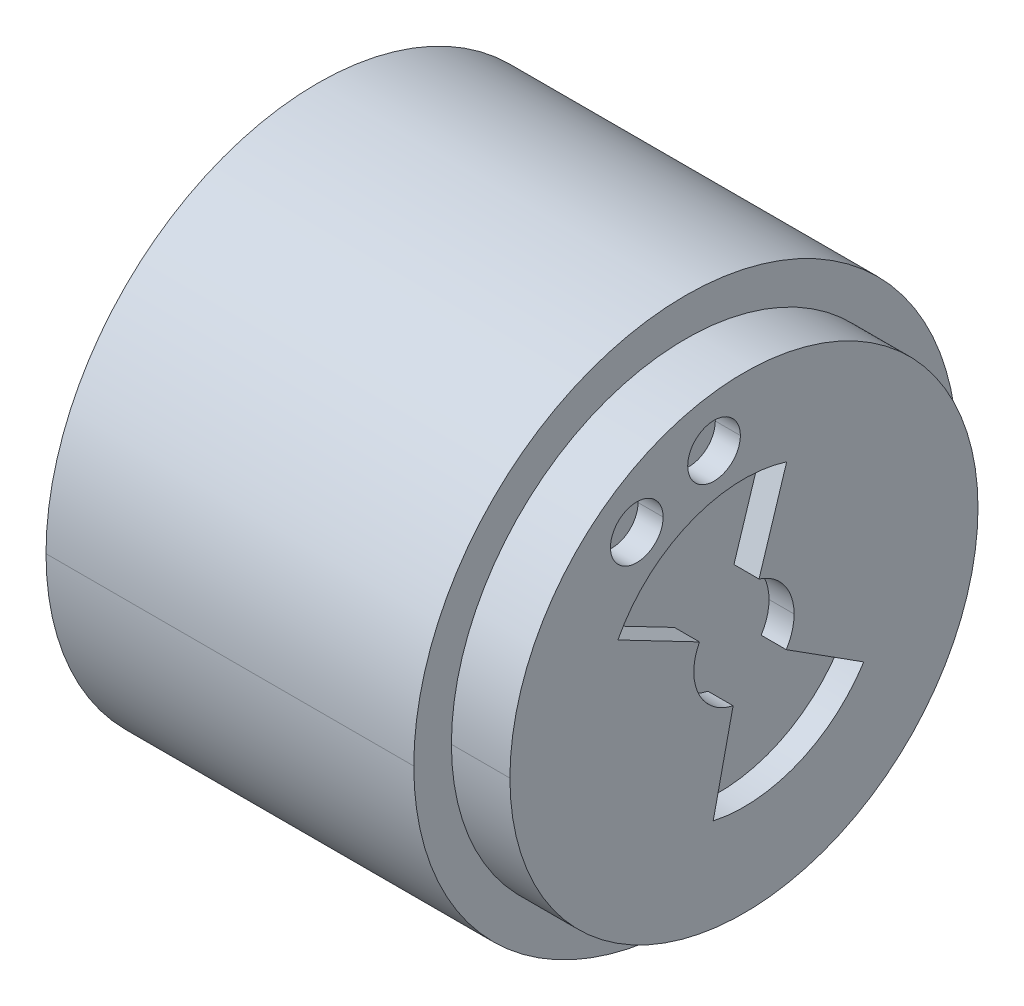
ISO-10303-21;
HEADER;
FILE_DESCRIPTION(('STEP AP214'),'2;1');
FILE_NAME('part.step','',(''),(''),'','','');
FILE_SCHEMA(('AUTOMOTIVE_DESIGN { 1 0 10303 214 1 1 1 1 }'));
ENDSEC;
DATA;
#1=APPLICATION_CONTEXT('core data for automotive mechanical design processes');
#2=APPLICATION_PROTOCOL_DEFINITION('international standard','automotive_design',2000,#1);
#3=PRODUCT_CONTEXT('',#1,'mechanical');
#4=PRODUCT('Part','Part','',(#3));
#5=PRODUCT_RELATED_PRODUCT_CATEGORY('part','',(#4));
#6=PRODUCT_DEFINITION_FORMATION('','',#4);
#7=PRODUCT_DEFINITION_CONTEXT('part definition',#1,'design');
#8=PRODUCT_DEFINITION('design','',#6,#7);
#9=PRODUCT_DEFINITION_SHAPE('','',#8);
#10=(LENGTH_UNIT() NAMED_UNIT(*) SI_UNIT(.MILLI.,.METRE.));
#11=(NAMED_UNIT(*) PLANE_ANGLE_UNIT() SI_UNIT($,.RADIAN.));
#12=(NAMED_UNIT(*) SI_UNIT($,.STERADIAN.) SOLID_ANGLE_UNIT());
#13=UNCERTAINTY_MEASURE_WITH_UNIT(LENGTH_MEASURE(1.E-05),#10,'distance_accuracy_value','');
#14=(GEOMETRIC_REPRESENTATION_CONTEXT(3) GLOBAL_UNCERTAINTY_ASSIGNED_CONTEXT((#13)) GLOBAL_UNIT_ASSIGNED_CONTEXT((#10,
#11,#12)) REPRESENTATION_CONTEXT('',''));
#15=CARTESIAN_POINT('',(0.,0.,0.));
#16=DIRECTION('',(0.,0.,1.));
#17=DIRECTION('',(1.,0.,0.));
#18=AXIS2_PLACEMENT_3D('',#15,#16,#17);
#19=CARTESIAN_POINT('',(48.,0.,0.));
#20=DIRECTION('',(1.,0.,0.));
#21=DIRECTION('',(0.,1.,0.));
#22=AXIS2_PLACEMENT_3D('',#19,#20,#21);
#23=PLANE('',#22);
#24=CARTESIAN_POINT('',(48.,0.,0.));
#25=DIRECTION('',(1.,0.,0.));
#26=DIRECTION('',(0.,0.,-1.));
#27=AXIS2_PLACEMENT_3D('',#24,#25,#26);
#28=CIRCLE('',#27,6.);
#29=CARTESIAN_POINT('',(48.,2.77049167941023,5.32206499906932));
#30=VERTEX_POINT('',#29);
#31=CARTESIAN_POINT('',(48.,-5.8577760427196,1.29863768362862));
#32=VERTEX_POINT('',#31);
#33=EDGE_CURVE('E329',#30,#32,#28,.T.);
#34=ORIENTED_EDGE('',*,*,#33,.T.);
#35=DIRECTION('',(0.,-0.976296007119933,0.216439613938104));
#36=VECTOR('',#35,1.);
#37=CARTESIAN_POINT('',(48.,-5.8577760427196,1.29863768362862));
#38=LINE('',#37,#36);
#39=CARTESIAN_POINT('',(48.,-16.5970321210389,3.67947343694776));
#40=VERTEX_POINT('',#39);
#41=EDGE_CURVE('E11',#32,#40,#38,.T.);
#42=ORIENTED_EDGE('',*,*,#41,.T.);
#43=CARTESIAN_POINT('',(48.,0.,0.));
#44=DIRECTION('',(1.,0.,0.));
#45=DIRECTION('',(0.,0.,-1.));
#46=AXIS2_PLACEMENT_3D('',#43,#44,#45);
#47=CIRCLE('',#46,17.);
#48=CARTESIAN_POINT('',(48.,-9.13409334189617,-14.337654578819));
#49=VERTEX_POINT('',#48);
#50=EDGE_CURVE('E231',#40,#49,#47,.T.);
#51=ORIENTED_EDGE('',*,*,#50,.T.);
#52=DIRECTION('',(0.,0.537299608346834,0.84339144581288));
#53=VECTOR('',#52,1.);
#54=CARTESIAN_POINT('',(48.,-3.223797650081,-5.06034867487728));
#55=LINE('',#54,#53);
#56=CARTESIAN_POINT('',(48.,-3.223797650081,-5.06034867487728));
#57=VERTEX_POINT('',#56);
#58=EDGE_CURVE('E389',#49,#57,#55,.T.);
#59=ORIENTED_EDGE('',*,*,#58,.T.);
#60=CARTESIAN_POINT('',(48.,0.,0.));
#61=DIRECTION('',(1.,0.,0.));
#62=DIRECTION('',(0.,0.,-1.));
#63=AXIS2_PLACEMENT_3D('',#60,#61,#62);
#64=CIRCLE('',#63,6.);
#65=CARTESIAN_POINT('',(48.,0.,-6.));
#66=VERTEX_POINT('',#65);
#67=EDGE_CURVE('E317',#57,#66,#64,.T.);
#68=ORIENTED_EDGE('',*,*,#67,.T.);
#69=CARTESIAN_POINT('',(48.,0.,0.));
#70=DIRECTION('',(1.,0.,0.));
#71=DIRECTION('',(0.,0.,-1.));
#72=AXIS2_PLACEMENT_3D('',#69,#70,#71);
#73=CIRCLE('',#72,6.);
#74=CARTESIAN_POINT('',(48.,5.72230170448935,-1.80423479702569));
#75=VERTEX_POINT('',#74);
#76=EDGE_CURVE('E290',#66,#75,#73,.T.);
#77=ORIENTED_EDGE('',*,*,#76,.T.);
#78=DIRECTION('',(0.,0.953716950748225,-0.300705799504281));
#79=VECTOR('',#78,1.);
#80=CARTESIAN_POINT('',(48.,16.2131881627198,-5.11199859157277));
#81=LINE('',#80,#79);
#82=CARTESIAN_POINT('',(48.,16.2131881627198,-5.11199859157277));
#83=VERTEX_POINT('',#82);
#84=EDGE_CURVE('E320',#75,#83,#81,.T.);
#85=ORIENTED_EDGE('',*,*,#84,.T.);
#86=CARTESIAN_POINT('',(48.,0.,0.));
#87=DIRECTION('',(1.,0.,0.));
#88=DIRECTION('',(0.,0.,-1.));
#89=AXIS2_PLACEMENT_3D('',#86,#87,#88);
#90=CIRCLE('',#89,17.);
#91=CARTESIAN_POINT('',(48.,7.84972642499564,15.0791841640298));
#92=VERTEX_POINT('',#91);
#93=EDGE_CURVE('E333',#83,#92,#90,.T.);
#94=ORIENTED_EDGE('',*,*,#93,.T.);
#95=DIRECTION('',(0.,-0.461748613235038,-0.88701083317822));
#96=VECTOR('',#95,1.);
#97=CARTESIAN_POINT('',(48.,7.84972642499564,15.0791841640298));
#98=LINE('',#97,#96);
#99=EDGE_CURVE('E334',#92,#30,#98,.T.);
#100=ORIENTED_EDGE('',*,*,#99,.T.);
#101=EDGE_LOOP('',(#34,#42,#51,#59,#68,#77,#85,#94,#100));
#102=FACE_BOUND('',#101,.T.);
#103=ADVANCED_FACE('F16',(#102),#23,.T.);
#104=CARTESIAN_POINT('',(48.,-5.8577760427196,1.29863768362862));
#105=DIRECTION('',(0.,0.216439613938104,0.976296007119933));
#106=DIRECTION('',(1.,0.,0.));
#107=AXIS2_PLACEMENT_3D('',#104,#105,#106);
#108=PLANE('',#107);
#109=DIRECTION('',(0.,-0.976296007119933,0.216439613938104));
#110=VECTOR('',#109,1.);
#111=CARTESIAN_POINT('',(51.,-5.8577760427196,1.29863768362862));
#112=LINE('',#111,#110);
#113=CARTESIAN_POINT('',(51.,-5.8577760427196,1.29863768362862));
#114=VERTEX_POINT('',#113);
#115=CARTESIAN_POINT('',(51.,-16.5970321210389,3.67947343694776));
#116=VERTEX_POINT('',#115);
#117=EDGE_CURVE('E236',#114,#116,#112,.T.);
#118=ORIENTED_EDGE('',*,*,#117,.T.);
#119=DIRECTION('',(1.,0.,0.));
#120=VECTOR('',#119,1.);
#121=CARTESIAN_POINT('',(48.,-16.5970321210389,3.67947343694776));
#122=LINE('',#121,#120);
#123=EDGE_CURVE('E27',#40,#116,#122,.T.);
#124=ORIENTED_EDGE('',*,*,#123,.F.);
#125=ORIENTED_EDGE('',*,*,#41,.F.);
#126=DIRECTION('',(1.,0.,0.));
#127=VECTOR('',#126,1.);
#128=CARTESIAN_POINT('',(48.,-5.8577760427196,1.29863768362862));
#129=LINE('',#128,#127);
#130=EDGE_CURVE('E239',#32,#114,#129,.T.);
#131=ORIENTED_EDGE('',*,*,#130,.T.);
#132=EDGE_LOOP('',(#118,#124,#125,#131));
#133=FACE_BOUND('',#132,.T.);
#134=ADVANCED_FACE('F237',(#133),#108,.F.);
#135=CARTESIAN_POINT('',(48.,0.,0.));
#136=DIRECTION('',(1.,0.,0.));
#137=DIRECTION('',(0.,0.,-1.));
#138=AXIS2_PLACEMENT_3D('',#135,#136,#137);
#139=CYLINDRICAL_SURFACE('',#138,17.);
#140=CARTESIAN_POINT('',(51.,0.,0.));
#141=DIRECTION('',(1.,0.,0.));
#142=DIRECTION('',(0.,0.,-1.));
#143=AXIS2_PLACEMENT_3D('',#140,#141,#142);
#144=CIRCLE('',#143,17.);
#145=CARTESIAN_POINT('',(51.,-9.13409334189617,-14.337654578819));
#146=VERTEX_POINT('',#145);
#147=EDGE_CURVE('E229',#116,#146,#144,.T.);
#148=ORIENTED_EDGE('',*,*,#147,.T.);
#149=DIRECTION('',(1.,0.,0.));
#150=VECTOR('',#149,1.);
#151=CARTESIAN_POINT('',(48.,-9.13409334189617,-14.337654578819));
#152=LINE('',#151,#150);
#153=EDGE_CURVE('E313',#49,#146,#152,.T.);
#154=ORIENTED_EDGE('',*,*,#153,.F.);
#155=ORIENTED_EDGE('',*,*,#50,.F.);
#156=ORIENTED_EDGE('',*,*,#123,.T.);
#157=EDGE_LOOP('',(#148,#154,#155,#156));
#158=FACE_BOUND('',#157,.T.);
#159=ADVANCED_FACE('F226',(#158),#139,.F.);
#160=CARTESIAN_POINT('',(48.,-3.223797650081,-5.06034867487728));
#161=DIRECTION('',(0.,0.84339144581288,-0.537299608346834));
#162=DIRECTION('',(-1.,0.,0.));
#163=AXIS2_PLACEMENT_3D('',#160,#161,#162);
#164=PLANE('',#163);
#165=DIRECTION('',(0.,0.537299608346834,0.84339144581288));
#166=VECTOR('',#165,1.);
#167=CARTESIAN_POINT('',(51.,-3.223797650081,-5.06034867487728));
#168=LINE('',#167,#166);
#169=CARTESIAN_POINT('',(51.,-3.223797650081,-5.06034867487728));
#170=VERTEX_POINT('',#169);
#171=EDGE_CURVE('E248',#146,#170,#168,.T.);
#172=ORIENTED_EDGE('',*,*,#171,.T.);
#173=DIRECTION('',(1.,0.,0.));
#174=VECTOR('',#173,1.);
#175=CARTESIAN_POINT('',(48.,-3.223797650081,-5.06034867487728));
#176=LINE('',#175,#174);
#177=EDGE_CURVE('E152',#57,#170,#176,.T.);
#178=ORIENTED_EDGE('',*,*,#177,.F.);
#179=ORIENTED_EDGE('',*,*,#58,.F.);
#180=ORIENTED_EDGE('',*,*,#153,.T.);
#181=EDGE_LOOP('',(#172,#178,#179,#180));
#182=FACE_BOUND('',#181,.T.);
#183=ADVANCED_FACE('F735',(#182),#164,.F.);
#184=CARTESIAN_POINT('',(48.,0.,0.));
#185=DIRECTION('',(1.,0.,0.));
#186=DIRECTION('',(0.,0.,-1.));
#187=AXIS2_PLACEMENT_3D('',#184,#185,#186);
#188=CYLINDRICAL_SURFACE('',#187,6.);
#189=DIRECTION('',(1.,0.,0.));
#190=VECTOR('',#189,1.);
#191=CARTESIAN_POINT('',(48.,0.,-6.));
#192=LINE('',#191,#190);
#193=CARTESIAN_POINT('',(51.,0.,-6.));
#194=VERTEX_POINT('',#193);
#195=EDGE_CURVE('E285',#66,#194,#192,.T.);
#196=ORIENTED_EDGE('',*,*,#195,.F.);
#197=ORIENTED_EDGE('',*,*,#67,.F.);
#198=ORIENTED_EDGE('',*,*,#177,.T.);
#199=CARTESIAN_POINT('',(51.,0.,0.));
#200=DIRECTION('',(1.,0.,0.));
#201=DIRECTION('',(0.,0.,-1.));
#202=AXIS2_PLACEMENT_3D('',#199,#200,#201);
#203=CIRCLE('',#202,6.);
#204=EDGE_CURVE('E255',#170,#194,#203,.T.);
#205=ORIENTED_EDGE('',*,*,#204,.T.);
#206=EDGE_LOOP('',(#196,#197,#198,#205));
#207=FACE_BOUND('',#206,.T.);
#208=ADVANCED_FACE('F462',(#207),#188,.F.);
#209=CARTESIAN_POINT('',(48.,16.2131881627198,-5.11199859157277));
#210=DIRECTION('',(0.,-0.300705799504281,-0.953716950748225));
#211=DIRECTION('',(0.,-0.953716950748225,0.300705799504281));
#212=AXIS2_PLACEMENT_3D('',#209,#210,#211);
#213=PLANE('',#212);
#214=DIRECTION('',(0.,0.953716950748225,-0.300705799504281));
#215=VECTOR('',#214,1.);
#216=CARTESIAN_POINT('',(51.,16.2131881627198,-5.11199859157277));
#217=LINE('',#216,#215);
#218=CARTESIAN_POINT('',(51.,5.72230170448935,-1.80423479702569));
#219=VERTEX_POINT('',#218);
#220=CARTESIAN_POINT('',(51.,16.2131881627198,-5.11199859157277));
#221=VERTEX_POINT('',#220);
#222=EDGE_CURVE('E351',#219,#221,#217,.T.);
#223=ORIENTED_EDGE('',*,*,#222,.T.);
#224=DIRECTION('',(1.,0.,0.));
#225=VECTOR('',#224,1.);
#226=CARTESIAN_POINT('',(48.,16.2131881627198,-5.11199859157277));
#227=LINE('',#226,#225);
#228=EDGE_CURVE('E169',#83,#221,#227,.T.);
#229=ORIENTED_EDGE('',*,*,#228,.F.);
#230=ORIENTED_EDGE('',*,*,#84,.F.);
#231=DIRECTION('',(1.,0.,0.));
#232=VECTOR('',#231,1.);
#233=CARTESIAN_POINT('',(48.,5.72230170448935,-1.80423479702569));
#234=LINE('',#233,#232);
#235=EDGE_CURVE('E305',#75,#219,#234,.T.);
#236=ORIENTED_EDGE('',*,*,#235,.T.);
#237=EDGE_LOOP('',(#223,#229,#230,#236));
#238=FACE_BOUND('',#237,.T.);
#239=ADVANCED_FACE('F459',(#238),#213,.F.);
#240=CARTESIAN_POINT('',(48.,0.,0.));
#241=DIRECTION('',(1.,0.,0.));
#242=DIRECTION('',(0.,0.,-1.));
#243=AXIS2_PLACEMENT_3D('',#240,#241,#242);
#244=CYLINDRICAL_SURFACE('',#243,17.);
#245=CARTESIAN_POINT('',(51.,0.,0.));
#246=DIRECTION('',(1.,0.,0.));
#247=DIRECTION('',(0.,0.,-1.));
#248=AXIS2_PLACEMENT_3D('',#245,#246,#247);
#249=CIRCLE('',#248,17.);
#250=CARTESIAN_POINT('',(51.,7.84972642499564,15.0791841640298));
#251=VERTEX_POINT('',#250);
#252=EDGE_CURVE('E280',#221,#251,#249,.T.);
#253=ORIENTED_EDGE('',*,*,#252,.T.);
#254=DIRECTION('',(1.,0.,0.));
#255=VECTOR('',#254,1.);
#256=CARTESIAN_POINT('',(48.,7.84972642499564,15.0791841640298));
#257=LINE('',#256,#255);
#258=EDGE_CURVE('E330',#92,#251,#257,.T.);
#259=ORIENTED_EDGE('',*,*,#258,.F.);
#260=ORIENTED_EDGE('',*,*,#93,.F.);
#261=ORIENTED_EDGE('',*,*,#228,.T.);
#262=EDGE_LOOP('',(#253,#259,#260,#261));
#263=FACE_BOUND('',#262,.T.);
#264=ADVANCED_FACE('F457',(#263),#244,.F.);
#265=CARTESIAN_POINT('',(48.,7.84972642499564,15.0791841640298));
#266=DIRECTION('',(0.,-0.88701083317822,0.461748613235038));
#267=DIRECTION('',(-1.,0.,0.));
#268=AXIS2_PLACEMENT_3D('',#265,#266,#267);
#269=PLANE('',#268);
#270=DIRECTION('',(0.,-0.461748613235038,-0.88701083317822));
#271=VECTOR('',#270,1.);
#272=CARTESIAN_POINT('',(51.,7.84972642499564,15.0791841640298));
#273=LINE('',#272,#271);
#274=CARTESIAN_POINT('',(51.,2.77049167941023,5.32206499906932));
#275=VERTEX_POINT('',#274);
#276=EDGE_CURVE('E276',#251,#275,#273,.T.);
#277=ORIENTED_EDGE('',*,*,#276,.T.);
#278=DIRECTION('',(1.,0.,0.));
#279=VECTOR('',#278,1.);
#280=CARTESIAN_POINT('',(48.,2.77049167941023,5.32206499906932));
#281=LINE('',#280,#279);
#282=EDGE_CURVE('E365',#30,#275,#281,.T.);
#283=ORIENTED_EDGE('',*,*,#282,.F.);
#284=ORIENTED_EDGE('',*,*,#99,.F.);
#285=ORIENTED_EDGE('',*,*,#258,.T.);
#286=EDGE_LOOP('',(#277,#283,#284,#285));
#287=FACE_BOUND('',#286,.T.);
#288=ADVANCED_FACE('F473',(#287),#269,.F.);
#289=CARTESIAN_POINT('',(48.,0.,0.));
#290=DIRECTION('',(1.,0.,0.));
#291=DIRECTION('',(0.,0.,-1.));
#292=AXIS2_PLACEMENT_3D('',#289,#290,#291);
#293=CYLINDRICAL_SURFACE('',#292,6.);
#294=CARTESIAN_POINT('',(51.,0.,0.));
#295=DIRECTION('',(1.,0.,0.));
#296=DIRECTION('',(0.,0.,-1.));
#297=AXIS2_PLACEMENT_3D('',#294,#295,#296);
#298=CIRCLE('',#297,6.);
#299=EDGE_CURVE('E281',#275,#114,#298,.T.);
#300=ORIENTED_EDGE('',*,*,#299,.T.);
#301=ORIENTED_EDGE('',*,*,#130,.F.);
#302=ORIENTED_EDGE('',*,*,#33,.F.);
#303=ORIENTED_EDGE('',*,*,#282,.T.);
#304=EDGE_LOOP('',(#300,#301,#302,#303));
#305=FACE_BOUND('',#304,.T.);
#306=ADVANCED_FACE('F470',(#305),#293,.F.);
#307=CARTESIAN_POINT('',(48.,21.7068758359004,3.57932136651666));
#308=DIRECTION('',(1.,0.,0.));
#309=DIRECTION('',(0.,1.,0.));
#310=AXIS2_PLACEMENT_3D('',#307,#308,#309);
#311=PLANE('',#310);
#312=CARTESIAN_POINT('',(48.,21.7068758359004,3.57932136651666));
#313=DIRECTION('',(1.,0.,0.));
#314=DIRECTION('',(0.,0.,-1.));
#315=AXIS2_PLACEMENT_3D('',#312,#313,#314);
#316=CIRCLE('',#315,3.15);
#317=CARTESIAN_POINT('',(48.,21.7068758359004,0.429321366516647));
#318=VERTEX_POINT('',#317);
#319=CARTESIAN_POINT('',(48.,21.7068758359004,6.72932136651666));
#320=VERTEX_POINT('',#319);
#321=EDGE_CURVE('E189',#318,#320,#316,.T.);
#322=ORIENTED_EDGE('',*,*,#321,.T.);
#323=CARTESIAN_POINT('',(48.,21.7068758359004,3.57932136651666));
#324=DIRECTION('',(1.,0.,0.));
#325=DIRECTION('',(0.,0.,-1.));
#326=AXIS2_PLACEMENT_3D('',#323,#324,#325);
#327=CIRCLE('',#326,3.15);
#328=EDGE_CURVE('E348',#320,#318,#327,.T.);
#329=ORIENTED_EDGE('',*,*,#328,.T.);
#330=EDGE_LOOP('',(#322,#329));
#331=FACE_BOUND('',#330,.T.);
#332=ADVANCED_FACE('F472',(#331),#311,.T.);
#333=CARTESIAN_POINT('',(48.,21.7068758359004,3.57932136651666));
#334=DIRECTION('',(1.,0.,0.));
#335=DIRECTION('',(0.,0.,-1.));
#336=AXIS2_PLACEMENT_3D('',#333,#334,#335);
#337=CYLINDRICAL_SURFACE('',#336,3.15);
#338=DIRECTION('',(1.,0.,0.));
#339=VECTOR('',#338,1.);
#340=CARTESIAN_POINT('',(48.,21.7068758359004,6.72932136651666));
#341=LINE('',#340,#339);
#342=CARTESIAN_POINT('',(51.,21.7068758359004,6.72932136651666));
#343=VERTEX_POINT('',#342);
#344=EDGE_CURVE('E326',#320,#343,#341,.T.);
#345=ORIENTED_EDGE('',*,*,#344,.F.);
#346=ORIENTED_EDGE('',*,*,#321,.F.);
#347=DIRECTION('',(1.,0.,0.));
#348=VECTOR('',#347,1.);
#349=CARTESIAN_POINT('',(48.,21.7068758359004,0.429321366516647));
#350=LINE('',#349,#348);
#351=CARTESIAN_POINT('',(51.,21.7068758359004,0.429321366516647));
#352=VERTEX_POINT('',#351);
#353=EDGE_CURVE('E325',#318,#352,#350,.T.);
#354=ORIENTED_EDGE('',*,*,#353,.T.);
#355=CARTESIAN_POINT('',(51.,21.7068758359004,3.57932136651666));
#356=DIRECTION('',(1.,0.,0.));
#357=DIRECTION('',(0.,0.,-1.));
#358=AXIS2_PLACEMENT_3D('',#355,#356,#357);
#359=CIRCLE('',#358,3.15);
#360=EDGE_CURVE('E200',#352,#343,#359,.T.);
#361=ORIENTED_EDGE('',*,*,#360,.T.);
#362=EDGE_LOOP('',(#345,#346,#354,#361));
#363=FACE_BOUND('',#362,.T.);
#364=ADVANCED_FACE('F428',(#363),#337,.F.);
#365=CARTESIAN_POINT('',(48.,17.8800415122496,12.8181166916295));
#366=DIRECTION('',(-1.,0.,0.));
#367=DIRECTION('',(0.,0.,1.));
#368=AXIS2_PLACEMENT_3D('',#365,#366,#367);
#369=PLANE('',#368);
#370=CARTESIAN_POINT('',(48.,17.8800415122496,12.8181166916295));
#371=DIRECTION('',(1.,0.,0.));
#372=DIRECTION('',(0.,0.,1.));
#373=AXIS2_PLACEMENT_3D('',#370,#371,#372);
#374=CIRCLE('',#373,3.15);
#375=CARTESIAN_POINT('',(48.,17.8800415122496,9.66811669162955));
#376=VERTEX_POINT('',#375);
#377=CARTESIAN_POINT('',(48.,17.8800415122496,15.9681166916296));
#378=VERTEX_POINT('',#377);
#379=EDGE_CURVE('E398',#376,#378,#374,.T.);
#380=ORIENTED_EDGE('',*,*,#379,.T.);
#381=CARTESIAN_POINT('',(48.,17.8800415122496,12.8181166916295));
#382=DIRECTION('',(1.,0.,0.));
#383=DIRECTION('',(0.,0.,1.));
#384=AXIS2_PLACEMENT_3D('',#381,#382,#383);
#385=CIRCLE('',#384,3.15);
#386=EDGE_CURVE('E366',#378,#376,#385,.T.);
#387=ORIENTED_EDGE('',*,*,#386,.T.);
#388=EDGE_LOOP('',(#380,#387));
#389=FACE_BOUND('',#388,.T.);
#390=ADVANCED_FACE('F445',(#389),#369,.F.);
#391=CARTESIAN_POINT('',(48.,17.8800415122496,12.8181166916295));
#392=DIRECTION('',(1.,0.,0.));
#393=DIRECTION('',(0.,0.,-1.));
#394=AXIS2_PLACEMENT_3D('',#391,#392,#393);
#395=CYLINDRICAL_SURFACE('',#394,3.15);
#396=DIRECTION('',(1.,0.,0.));
#397=VECTOR('',#396,1.);
#398=CARTESIAN_POINT('',(48.,17.8800415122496,15.9681166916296));
#399=LINE('',#398,#397);
#400=CARTESIAN_POINT('',(51.,17.8800415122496,15.9681166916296));
#401=VERTEX_POINT('',#400);
#402=EDGE_CURVE('E370',#378,#401,#399,.T.);
#403=ORIENTED_EDGE('',*,*,#402,.F.);
#404=ORIENTED_EDGE('',*,*,#379,.F.);
#405=DIRECTION('',(1.,0.,0.));
#406=VECTOR('',#405,1.);
#407=CARTESIAN_POINT('',(48.,17.8800415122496,9.66811669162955));
#408=LINE('',#407,#406);
#409=CARTESIAN_POINT('',(51.,17.8800415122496,9.66811669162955));
#410=VERTEX_POINT('',#409);
#411=EDGE_CURVE('E338',#376,#410,#408,.T.);
#412=ORIENTED_EDGE('',*,*,#411,.T.);
#413=CARTESIAN_POINT('',(51.,17.8800415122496,12.8181166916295));
#414=DIRECTION('',(1.,0.,0.));
#415=DIRECTION('',(0.,0.,1.));
#416=AXIS2_PLACEMENT_3D('',#413,#414,#415);
#417=CIRCLE('',#416,3.15);
#418=EDGE_CURVE('E401',#410,#401,#417,.T.);
#419=ORIENTED_EDGE('',*,*,#418,.T.);
#420=EDGE_LOOP('',(#403,#404,#412,#419));
#421=FACE_BOUND('',#420,.T.);
#422=ADVANCED_FACE('F435',(#421),#395,.F.);
#423=CARTESIAN_POINT('',(51.,0.,0.));
#424=DIRECTION('',(1.,0.,0.));
#425=DIRECTION('',(0.,1.,0.));
#426=AXIS2_PLACEMENT_3D('',#423,#424,#425);
#427=PLANE('',#426);
#428=ORIENTED_EDGE('',*,*,#418,.F.);
#429=CARTESIAN_POINT('',(51.,17.8800415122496,12.8181166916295));
#430=DIRECTION('',(1.,0.,0.));
#431=DIRECTION('',(0.,0.,1.));
#432=AXIS2_PLACEMENT_3D('',#429,#430,#431);
#433=CIRCLE('',#432,3.15);
#434=EDGE_CURVE('E371',#401,#410,#433,.T.);
#435=ORIENTED_EDGE('',*,*,#434,.F.);
#436=EDGE_LOOP('',(#428,#435));
#437=FACE_BOUND('',#436,.T.);
#438=ORIENTED_EDGE('',*,*,#360,.F.);
#439=CARTESIAN_POINT('',(51.,21.7068758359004,3.57932136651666));
#440=DIRECTION('',(1.,0.,0.));
#441=DIRECTION('',(0.,0.,-1.));
#442=AXIS2_PLACEMENT_3D('',#439,#440,#441);
#443=CIRCLE('',#442,3.15);
#444=EDGE_CURVE('E321',#343,#352,#443,.T.);
#445=ORIENTED_EDGE('',*,*,#444,.F.);
#446=EDGE_LOOP('',(#438,#445));
#447=FACE_BOUND('',#446,.T.);
#448=ORIENTED_EDGE('',*,*,#299,.F.);
#449=ORIENTED_EDGE('',*,*,#276,.F.);
#450=ORIENTED_EDGE('',*,*,#252,.F.);
#451=ORIENTED_EDGE('',*,*,#222,.F.);
#452=CARTESIAN_POINT('',(51.,0.,0.));
#453=DIRECTION('',(1.,0.,0.));
#454=DIRECTION('',(0.,0.,-1.));
#455=AXIS2_PLACEMENT_3D('',#452,#453,#454);
#456=CIRCLE('',#455,6.);
#457=EDGE_CURVE('E289',#194,#219,#456,.T.);
#458=ORIENTED_EDGE('',*,*,#457,.F.);
#459=ORIENTED_EDGE('',*,*,#204,.F.);
#460=ORIENTED_EDGE('',*,*,#171,.F.);
#461=ORIENTED_EDGE('',*,*,#147,.F.);
#462=ORIENTED_EDGE('',*,*,#117,.F.);
#463=EDGE_LOOP('',(#448,#449,#450,#451,#458,#459,#460,#461,#462));
#464=FACE_BOUND('',#463,.T.);
#465=CARTESIAN_POINT('',(51.,0.,0.));
#466=DIRECTION('',(1.,0.,0.));
#467=DIRECTION('',(0.,0.,-1.));
#468=AXIS2_PLACEMENT_3D('',#465,#466,#467);
#469=CIRCLE('',#468,28.);
#470=CARTESIAN_POINT('',(51.,0.,-28.));
#471=VERTEX_POINT('',#470);
#472=CARTESIAN_POINT('',(51.,0.,28.));
#473=VERTEX_POINT('',#472);
#474=EDGE_CURVE('E295',#471,#473,#469,.T.);
#475=ORIENTED_EDGE('',*,*,#474,.T.);
#476=CARTESIAN_POINT('',(51.,0.,0.));
#477=DIRECTION('',(1.,0.,0.));
#478=DIRECTION('',(0.,0.,-1.));
#479=AXIS2_PLACEMENT_3D('',#476,#477,#478);
#480=CIRCLE('',#479,28.);
#481=EDGE_CURVE('E282',#473,#471,#480,.T.);
#482=ORIENTED_EDGE('',*,*,#481,.T.);
#483=EDGE_LOOP('',(#475,#482));
#484=FACE_BOUND('',#483,.T.);
#485=ADVANCED_FACE('F245',(#437,#447,#464,#484),#427,.T.);
#486=CARTESIAN_POINT('',(44.,0.,0.));
#487=DIRECTION('',(1.,0.,0.));
#488=DIRECTION('',(0.,0.,-1.));
#489=AXIS2_PLACEMENT_3D('',#486,#487,#488);
#490=CYLINDRICAL_SURFACE('',#489,28.);
#491=DIRECTION('',(1.,0.,0.));
#492=VECTOR('',#491,1.);
#493=CARTESIAN_POINT('',(44.,0.,28.));
#494=LINE('',#493,#492);
#495=CARTESIAN_POINT('',(44.,0.,28.));
#496=VERTEX_POINT('',#495);
#497=EDGE_CURVE('E291',#496,#473,#494,.T.);
#498=ORIENTED_EDGE('',*,*,#497,.F.);
#499=CARTESIAN_POINT('',(44.,0.,0.));
#500=DIRECTION('',(1.,0.,0.));
#501=DIRECTION('',(0.,0.,-1.));
#502=AXIS2_PLACEMENT_3D('',#499,#500,#501);
#503=CIRCLE('',#502,28.);
#504=CARTESIAN_POINT('',(44.,0.,-28.));
#505=VERTEX_POINT('',#504);
#506=EDGE_CURVE('E20',#496,#505,#503,.T.);
#507=ORIENTED_EDGE('',*,*,#506,.T.);
#508=DIRECTION('',(1.,0.,0.));
#509=VECTOR('',#508,1.);
#510=CARTESIAN_POINT('',(44.,0.,-28.));
#511=LINE('',#510,#509);
#512=EDGE_CURVE('E267',#505,#471,#511,.T.);
#513=ORIENTED_EDGE('',*,*,#512,.T.);
#514=ORIENTED_EDGE('',*,*,#481,.F.);
#515=EDGE_LOOP('',(#498,#507,#513,#514));
#516=FACE_BOUND('',#515,.T.);
#517=ADVANCED_FACE('F434',(#516),#490,.T.);
#518=CARTESIAN_POINT('',(44.,0.,0.));
#519=DIRECTION('',(1.,0.,0.));
#520=DIRECTION('',(0.,1.,0.));
#521=AXIS2_PLACEMENT_3D('',#518,#519,#520);
#522=PLANE('',#521);
#523=CARTESIAN_POINT('',(44.,0.,0.));
#524=DIRECTION('',(1.,0.,0.));
#525=DIRECTION('',(0.,0.,-1.));
#526=AXIS2_PLACEMENT_3D('',#523,#524,#525);
#527=CIRCLE('',#526,28.);
#528=EDGE_CURVE('E296',#505,#496,#527,.T.);
#529=ORIENTED_EDGE('',*,*,#528,.F.);
#530=ORIENTED_EDGE('',*,*,#506,.F.);
#531=EDGE_LOOP('',(#529,#530));
#532=FACE_BOUND('',#531,.T.);
#533=CARTESIAN_POINT('',(44.,0.,0.));
#534=DIRECTION('',(1.,0.,0.));
#535=DIRECTION('',(0.,0.,-1.));
#536=AXIS2_PLACEMENT_3D('',#533,#534,#535);
#537=CIRCLE('',#536,32.5);
#538=CARTESIAN_POINT('',(44.,0.,32.5));
#539=VERTEX_POINT('',#538);
#540=CARTESIAN_POINT('',(44.,0.,-32.5));
#541=VERTEX_POINT('',#540);
#542=EDGE_CURVE('E310',#539,#541,#537,.T.);
#543=ORIENTED_EDGE('',*,*,#542,.T.);
#544=CARTESIAN_POINT('',(44.,0.,0.));
#545=DIRECTION('',(1.,0.,0.));
#546=DIRECTION('',(0.,0.,-1.));
#547=AXIS2_PLACEMENT_3D('',#544,#545,#546);
#548=CIRCLE('',#547,32.5);
#549=EDGE_CURVE('E271',#541,#539,#548,.T.);
#550=ORIENTED_EDGE('',*,*,#549,.T.);
#551=EDGE_LOOP('',(#543,#550));
#552=FACE_BOUND('',#551,.T.);
#553=ADVANCED_FACE('F443',(#532,#552),#522,.T.);
#554=CARTESIAN_POINT('',(-0.3,0.,0.));
#555=DIRECTION('',(-1.,0.,0.));
#556=DIRECTION('',(0.,0.,1.));
#557=AXIS2_PLACEMENT_3D('',#554,#555,#556);
#558=PLANE('',#557);
#559=CARTESIAN_POINT('',(-0.3,0.,0.));
#560=DIRECTION('',(-1.,0.,0.));
#561=DIRECTION('',(0.,0.,1.));
#562=AXIS2_PLACEMENT_3D('',#559,#560,#561);
#563=CIRCLE('',#562,20.);
#564=CARTESIAN_POINT('',(-0.3,0.,-20.));
#565=VERTEX_POINT('',#564);
#566=CARTESIAN_POINT('',(-0.3,0.,20.));
#567=VERTEX_POINT('',#566);
#568=EDGE_CURVE('E300',#565,#567,#563,.T.);
#569=ORIENTED_EDGE('',*,*,#568,.T.);
#570=CARTESIAN_POINT('',(-0.3,0.,0.));
#571=DIRECTION('',(-1.,0.,0.));
#572=DIRECTION('',(0.,0.,1.));
#573=AXIS2_PLACEMENT_3D('',#570,#571,#572);
#574=CIRCLE('',#573,20.);
#575=EDGE_CURVE('E263',#567,#565,#574,.T.);
#576=ORIENTED_EDGE('',*,*,#575,.T.);
#577=EDGE_LOOP('',(#569,#576));
#578=FACE_BOUND('',#577,.T.);
#579=ADVANCED_FACE('F562',(#578),#558,.T.);
#580=CARTESIAN_POINT('',(-0.3,0.,0.));
#581=DIRECTION('',(1.,0.,0.));
#582=DIRECTION('',(0.,0.,-1.));
#583=AXIS2_PLACEMENT_3D('',#580,#581,#582);
#584=CYLINDRICAL_SURFACE('',#583,20.);
#585=DIRECTION('',(1.,0.,0.));
#586=VECTOR('',#585,1.);
#587=CARTESIAN_POINT('',(-0.3,0.,20.));
#588=LINE('',#587,#586);
#589=CARTESIAN_POINT('',(0.,0.,20.));
#590=VERTEX_POINT('',#589);
#591=EDGE_CURVE('E262',#567,#590,#588,.T.);
#592=ORIENTED_EDGE('',*,*,#591,.F.);
#593=ORIENTED_EDGE('',*,*,#568,.F.);
#594=DIRECTION('',(1.,0.,0.));
#595=VECTOR('',#594,1.);
#596=CARTESIAN_POINT('',(-0.3,0.,-20.));
#597=LINE('',#596,#595);
#598=CARTESIAN_POINT('',(0.,0.,-20.));
#599=VERTEX_POINT('',#598);
#600=EDGE_CURVE('E261',#565,#599,#597,.T.);
#601=ORIENTED_EDGE('',*,*,#600,.T.);
#602=CARTESIAN_POINT('',(0.,0.,0.));
#603=DIRECTION('',(-1.,0.,0.));
#604=DIRECTION('',(0.,0.,1.));
#605=AXIS2_PLACEMENT_3D('',#602,#603,#604);
#606=CIRCLE('',#605,20.);
#607=EDGE_CURVE('E297',#599,#590,#606,.T.);
#608=ORIENTED_EDGE('',*,*,#607,.T.);
#609=EDGE_LOOP('',(#592,#593,#601,#608));
#610=FACE_BOUND('',#609,.T.);
#611=ADVANCED_FACE('F467',(#610),#584,.T.);
#612=CARTESIAN_POINT('',(0.,0.,0.));
#613=DIRECTION('',(1.,0.,0.));
#614=DIRECTION('',(0.,1.,0.));
#615=AXIS2_PLACEMENT_3D('',#612,#613,#614);
#616=PLANE('',#615);
#617=ORIENTED_EDGE('',*,*,#607,.F.);
#618=CARTESIAN_POINT('',(0.,0.,0.));
#619=DIRECTION('',(-1.,0.,0.));
#620=DIRECTION('',(0.,0.,1.));
#621=AXIS2_PLACEMENT_3D('',#618,#619,#620);
#622=CIRCLE('',#621,20.);
#623=EDGE_CURVE('E258',#590,#599,#622,.T.);
#624=ORIENTED_EDGE('',*,*,#623,.F.);
#625=EDGE_LOOP('',(#617,#624));
#626=FACE_BOUND('',#625,.T.);
#627=CARTESIAN_POINT('',(0.,0.,0.));
#628=DIRECTION('',(1.,0.,0.));
#629=DIRECTION('',(0.,0.,-1.));
#630=AXIS2_PLACEMENT_3D('',#627,#628,#629);
#631=CIRCLE('',#630,32.5);
#632=CARTESIAN_POINT('',(0.,0.,32.5));
#633=VERTEX_POINT('',#632);
#634=CARTESIAN_POINT('',(0.,0.,-32.5));
#635=VERTEX_POINT('',#634);
#636=EDGE_CURVE('E301',#633,#635,#631,.T.);
#637=ORIENTED_EDGE('',*,*,#636,.F.);
#638=CARTESIAN_POINT('',(0.,0.,0.));
#639=DIRECTION('',(1.,0.,0.));
#640=DIRECTION('',(0.,0.,-1.));
#641=AXIS2_PLACEMENT_3D('',#638,#639,#640);
#642=CIRCLE('',#641,32.5);
#643=EDGE_CURVE('E311',#635,#633,#642,.T.);
#644=ORIENTED_EDGE('',*,*,#643,.F.);
#645=EDGE_LOOP('',(#637,#644));
#646=FACE_BOUND('',#645,.T.);
#647=ADVANCED_FACE('F464',(#626,#646),#616,.F.);
#648=CARTESIAN_POINT('',(51.,0.,0.));
#649=DIRECTION('',(-1.,0.,0.));
#650=DIRECTION('',(0.,0.,1.));
#651=AXIS2_PLACEMENT_3D('',#648,#649,#650);
#652=CYLINDRICAL_SURFACE('',#651,32.5);
#653=DIRECTION('',(-1.,0.,0.));
#654=VECTOR('',#653,1.);
#655=CARTESIAN_POINT('',(51.,0.,-32.5));
#656=LINE('',#655,#654);
#657=EDGE_CURVE('E275',#541,#635,#656,.T.);
#658=ORIENTED_EDGE('',*,*,#657,.F.);
#659=ORIENTED_EDGE('',*,*,#542,.F.);
#660=DIRECTION('',(-1.,0.,0.));
#661=VECTOR('',#660,1.);
#662=CARTESIAN_POINT('',(51.,0.,32.5));
#663=LINE('',#662,#661);
#664=EDGE_CURVE('E306',#539,#633,#663,.T.);
#665=ORIENTED_EDGE('',*,*,#664,.T.);
#666=ORIENTED_EDGE('',*,*,#636,.T.);
#667=EDGE_LOOP('',(#658,#659,#665,#666));
#668=FACE_BOUND('',#667,.T.);
#669=ADVANCED_FACE('F466',(#668),#652,.T.);
#670=CARTESIAN_POINT('',(51.,0.,0.));
#671=DIRECTION('',(-1.,0.,0.));
#672=DIRECTION('',(0.,0.,1.));
#673=AXIS2_PLACEMENT_3D('',#670,#671,#672);
#674=CYLINDRICAL_SURFACE('',#673,32.5);
#675=ORIENTED_EDGE('',*,*,#549,.F.);
#676=ORIENTED_EDGE('',*,*,#657,.T.);
#677=ORIENTED_EDGE('',*,*,#643,.T.);
#678=ORIENTED_EDGE('',*,*,#664,.F.);
#679=EDGE_LOOP('',(#675,#676,#677,#678));
#680=FACE_BOUND('',#679,.T.);
#681=ADVANCED_FACE('F18',(#680),#674,.T.);
#682=CARTESIAN_POINT('',(-0.3,0.,0.));
#683=DIRECTION('',(1.,0.,0.));
#684=DIRECTION('',(0.,0.,-1.));
#685=AXIS2_PLACEMENT_3D('',#682,#683,#684);
#686=CYLINDRICAL_SURFACE('',#685,20.);
#687=ORIENTED_EDGE('',*,*,#575,.F.);
#688=ORIENTED_EDGE('',*,*,#591,.T.);
#689=ORIENTED_EDGE('',*,*,#623,.T.);
#690=ORIENTED_EDGE('',*,*,#600,.F.);
#691=EDGE_LOOP('',(#687,#688,#689,#690));
#692=FACE_BOUND('',#691,.T.);
#693=ADVANCED_FACE('F609',(#692),#686,.T.);
#694=CARTESIAN_POINT('',(44.,0.,0.));
#695=DIRECTION('',(1.,0.,0.));
#696=DIRECTION('',(0.,0.,-1.));
#697=AXIS2_PLACEMENT_3D('',#694,#695,#696);
#698=CYLINDRICAL_SURFACE('',#697,28.);
#699=ORIENTED_EDGE('',*,*,#528,.T.);
#700=ORIENTED_EDGE('',*,*,#497,.T.);
#701=ORIENTED_EDGE('',*,*,#474,.F.);
#702=ORIENTED_EDGE('',*,*,#512,.F.);
#703=EDGE_LOOP('',(#699,#700,#701,#702));
#704=FACE_BOUND('',#703,.T.);
#705=ADVANCED_FACE('F618',(#704),#698,.T.);
#706=CARTESIAN_POINT('',(48.,17.8800415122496,12.8181166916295));
#707=DIRECTION('',(1.,0.,0.));
#708=DIRECTION('',(0.,0.,-1.));
#709=AXIS2_PLACEMENT_3D('',#706,#707,#708);
#710=CYLINDRICAL_SURFACE('',#709,3.15);
#711=ORIENTED_EDGE('',*,*,#386,.F.);
#712=ORIENTED_EDGE('',*,*,#402,.T.);
#713=ORIENTED_EDGE('',*,*,#434,.T.);
#714=ORIENTED_EDGE('',*,*,#411,.F.);
#715=EDGE_LOOP('',(#711,#712,#713,#714));
#716=FACE_BOUND('',#715,.T.);
#717=ADVANCED_FACE('F629',(#716),#710,.F.);
#718=CARTESIAN_POINT('',(48.,21.7068758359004,3.57932136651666));
#719=DIRECTION('',(1.,0.,0.));
#720=DIRECTION('',(0.,0.,-1.));
#721=AXIS2_PLACEMENT_3D('',#718,#719,#720);
#722=CYLINDRICAL_SURFACE('',#721,3.15);
#723=ORIENTED_EDGE('',*,*,#328,.F.);
#724=ORIENTED_EDGE('',*,*,#344,.T.);
#725=ORIENTED_EDGE('',*,*,#444,.T.);
#726=ORIENTED_EDGE('',*,*,#353,.F.);
#727=EDGE_LOOP('',(#723,#724,#725,#726));
#728=FACE_BOUND('',#727,.T.);
#729=ADVANCED_FACE('F431',(#728),#722,.F.);
#730=CARTESIAN_POINT('',(48.,0.,0.));
#731=DIRECTION('',(1.,0.,0.));
#732=DIRECTION('',(0.,0.,-1.));
#733=AXIS2_PLACEMENT_3D('',#730,#731,#732);
#734=CYLINDRICAL_SURFACE('',#733,6.);
#735=ORIENTED_EDGE('',*,*,#76,.F.);
#736=ORIENTED_EDGE('',*,*,#195,.T.);
#737=ORIENTED_EDGE('',*,*,#457,.T.);
#738=ORIENTED_EDGE('',*,*,#235,.F.);
#739=EDGE_LOOP('',(#735,#736,#737,#738));
#740=FACE_BOUND('',#739,.T.);
#741=ADVANCED_FACE('F649',(#740),#734,.F.);
#742=CLOSED_SHELL('',(#103,#134,#159,#183,#208,#239,#264,#288,#306,#332,#364,#390,#422,#485,
#517,#553,#579,#611,#647,#669,#681,#693,#705,#717,#729,#741));
#743=MANIFOLD_SOLID_BREP('B1',#742);
#744=ADVANCED_BREP_SHAPE_REPRESENTATION('',(#18,#743),#14);
#745=SHAPE_DEFINITION_REPRESENTATION(#9,#744);
ENDSEC;
END-ISO-10303-21;
